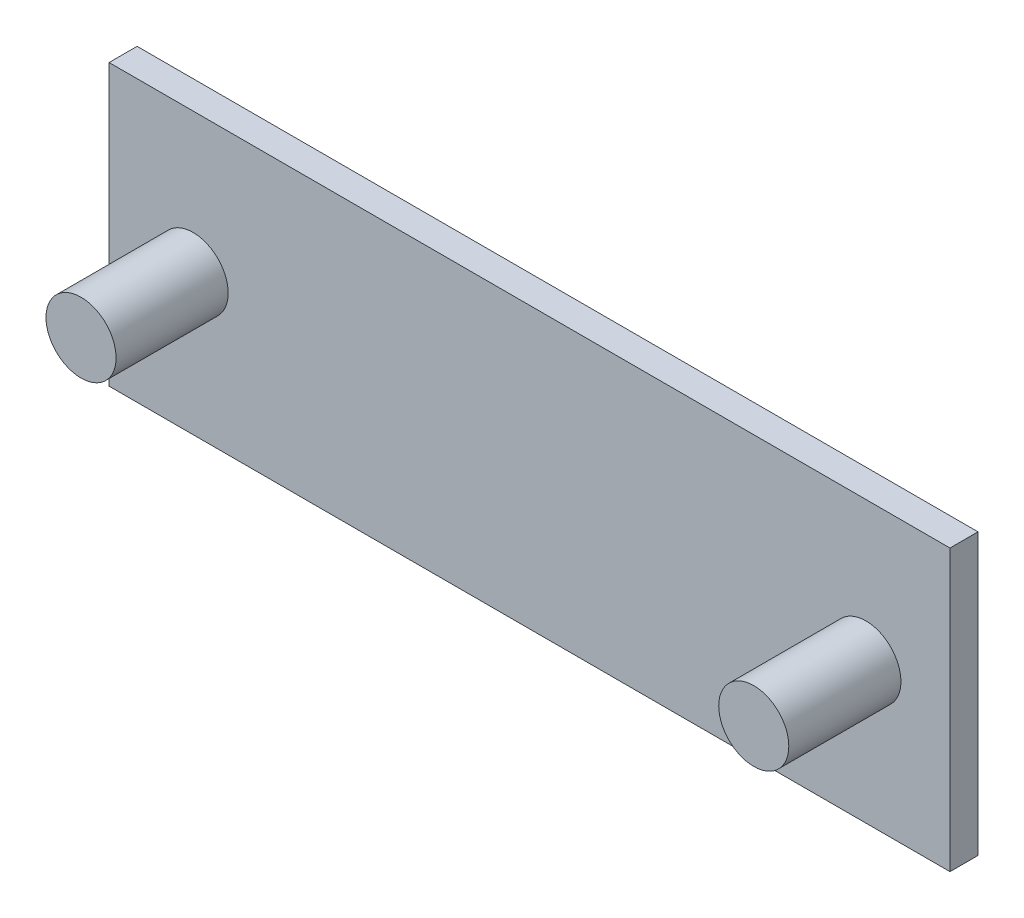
ISO-10303-21;
HEADER;
FILE_DESCRIPTION(('STEP AP214'),'2;1');
FILE_NAME('part.step','',(''),(''),'','','');
FILE_SCHEMA(('AUTOMOTIVE_DESIGN { 1 0 10303 214 1 1 1 1 }'));
ENDSEC;
DATA;
#1=APPLICATION_CONTEXT('core data for automotive mechanical design processes');
#2=APPLICATION_PROTOCOL_DEFINITION('international standard','automotive_design',2000,#1);
#3=PRODUCT_CONTEXT('',#1,'mechanical');
#4=PRODUCT('Part','Part','',(#3));
#5=PRODUCT_RELATED_PRODUCT_CATEGORY('part','',(#4));
#6=PRODUCT_DEFINITION_FORMATION('','',#4);
#7=PRODUCT_DEFINITION_CONTEXT('part definition',#1,'design');
#8=PRODUCT_DEFINITION('design','',#6,#7);
#9=PRODUCT_DEFINITION_SHAPE('','',#8);
#10=(LENGTH_UNIT() NAMED_UNIT(*) SI_UNIT(.MILLI.,.METRE.));
#11=(NAMED_UNIT(*) PLANE_ANGLE_UNIT() SI_UNIT($,.RADIAN.));
#12=(NAMED_UNIT(*) SI_UNIT($,.STERADIAN.) SOLID_ANGLE_UNIT());
#13=UNCERTAINTY_MEASURE_WITH_UNIT(LENGTH_MEASURE(1.E-05),#10,'distance_accuracy_value','');
#14=(GEOMETRIC_REPRESENTATION_CONTEXT(3) GLOBAL_UNCERTAINTY_ASSIGNED_CONTEXT((#13)) GLOBAL_UNIT_ASSIGNED_CONTEXT((#10,
#11,#12)) REPRESENTATION_CONTEXT('',''));
#15=CARTESIAN_POINT('',(0.,0.,0.));
#16=DIRECTION('',(0.,0.,1.));
#17=DIRECTION('',(1.,0.,0.));
#18=AXIS2_PLACEMENT_3D('',#15,#16,#17);
#19=CARTESIAN_POINT('',(0.,100.,10.));
#20=DIRECTION('',(0.,0.,-1.));
#21=DIRECTION('',(-1.,0.,0.));
#22=AXIS2_PLACEMENT_3D('',#19,#20,#21);
#23=PLANE('',#22);
#24=CARTESIAN_POINT('',(30.,50.,10.));
#25=DIRECTION('',(0.,0.,-1.));
#26=DIRECTION('',(-1.,0.,0.));
#27=AXIS2_PLACEMENT_3D('',#24,#25,#26);
#28=CIRCLE('',#27,12.5);
#29=CARTESIAN_POINT('',(17.5,50.,10.));
#30=VERTEX_POINT('',#29);
#31=EDGE_CURVE('E40',#30,#30,#28,.F.);
#32=ORIENTED_EDGE('',*,*,#31,.F.);
#33=EDGE_LOOP('',(#32));
#34=FACE_BOUND('',#33,.T.);
#35=DIRECTION('',(0.,-1.,0.));
#36=VECTOR('',#35,1.);
#37=CARTESIAN_POINT('',(0.,100.,10.));
#38=LINE('',#37,#36);
#39=CARTESIAN_POINT('',(0.,100.,10.));
#40=VERTEX_POINT('',#39);
#41=CARTESIAN_POINT('',(0.,0.,10.));
#42=VERTEX_POINT('',#41);
#43=EDGE_CURVE('E84',#40,#42,#38,.T.);
#44=ORIENTED_EDGE('',*,*,#43,.T.);
#45=DIRECTION('',(1.,0.,0.));
#46=VECTOR('',#45,1.);
#47=CARTESIAN_POINT('',(0.,0.,10.));
#48=LINE('',#47,#46);
#49=CARTESIAN_POINT('',(300.,0.,10.));
#50=VERTEX_POINT('',#49);
#51=EDGE_CURVE('E79',#42,#50,#48,.T.);
#52=ORIENTED_EDGE('',*,*,#51,.T.);
#53=DIRECTION('',(0.,1.,0.));
#54=VECTOR('',#53,1.);
#55=CARTESIAN_POINT('',(300.,0.,10.));
#56=LINE('',#55,#54);
#57=CARTESIAN_POINT('',(300.,100.,10.));
#58=VERTEX_POINT('',#57);
#59=EDGE_CURVE('E82',#50,#58,#56,.T.);
#60=ORIENTED_EDGE('',*,*,#59,.T.);
#61=DIRECTION('',(-1.,0.,0.));
#62=VECTOR('',#61,1.);
#63=CARTESIAN_POINT('',(300.,100.,10.));
#64=LINE('',#63,#62);
#65=EDGE_CURVE('E48',#58,#40,#64,.T.);
#66=ORIENTED_EDGE('',*,*,#65,.T.);
#67=EDGE_LOOP('',(#44,#52,#60,#66));
#68=FACE_BOUND('',#67,.T.);
#69=CARTESIAN_POINT('',(270.,50.,10.));
#70=DIRECTION('',(0.,0.,-1.));
#71=DIRECTION('',(-1.,0.,0.));
#72=AXIS2_PLACEMENT_3D('',#69,#70,#71);
#73=CIRCLE('',#72,12.5);
#74=CARTESIAN_POINT('',(257.5,50.,10.));
#75=VERTEX_POINT('',#74);
#76=EDGE_CURVE('E11',#75,#75,#73,.F.);
#77=ORIENTED_EDGE('',*,*,#76,.F.);
#78=EDGE_LOOP('',(#77));
#79=FACE_BOUND('',#78,.T.);
#80=ADVANCED_FACE('F31',(#34,#68,#79),#23,.F.);
#81=CARTESIAN_POINT('',(0.,100.,10.));
#82=DIRECTION('',(1.,0.,0.));
#83=DIRECTION('',(0.,1.,0.));
#84=AXIS2_PLACEMENT_3D('',#81,#82,#83);
#85=PLANE('',#84);
#86=DIRECTION('',(0.,-1.,0.));
#87=VECTOR('',#86,1.);
#88=CARTESIAN_POINT('',(0.,100.,0.));
#89=LINE('',#88,#87);
#90=CARTESIAN_POINT('',(0.,100.,0.));
#91=VERTEX_POINT('',#90);
#92=CARTESIAN_POINT('',(0.,0.,0.));
#93=VERTEX_POINT('',#92);
#94=EDGE_CURVE('E99',#91,#93,#89,.T.);
#95=ORIENTED_EDGE('',*,*,#94,.T.);
#96=DIRECTION('',(0.,0.,-1.));
#97=VECTOR('',#96,1.);
#98=CARTESIAN_POINT('',(0.,0.,10.));
#99=LINE('',#98,#97);
#100=EDGE_CURVE('E90',#42,#93,#99,.T.);
#101=ORIENTED_EDGE('',*,*,#100,.F.);
#102=ORIENTED_EDGE('',*,*,#43,.F.);
#103=DIRECTION('',(0.,0.,-1.));
#104=VECTOR('',#103,1.);
#105=CARTESIAN_POINT('',(0.,100.,10.));
#106=LINE('',#105,#104);
#107=EDGE_CURVE('E95',#40,#91,#106,.T.);
#108=ORIENTED_EDGE('',*,*,#107,.T.);
#109=EDGE_LOOP('',(#95,#101,#102,#108));
#110=FACE_BOUND('',#109,.T.);
#111=ADVANCED_FACE('F33',(#110),#85,.F.);
#112=CARTESIAN_POINT('',(0.,0.,10.));
#113=DIRECTION('',(0.,1.,0.));
#114=DIRECTION('',(0.,0.,1.));
#115=AXIS2_PLACEMENT_3D('',#112,#113,#114);
#116=PLANE('',#115);
#117=DIRECTION('',(1.,0.,0.));
#118=VECTOR('',#117,1.);
#119=CARTESIAN_POINT('',(0.,0.,0.));
#120=LINE('',#119,#118);
#121=CARTESIAN_POINT('',(300.,0.,0.));
#122=VERTEX_POINT('',#121);
#123=EDGE_CURVE('E89',#93,#122,#120,.T.);
#124=ORIENTED_EDGE('',*,*,#123,.T.);
#125=DIRECTION('',(0.,0.,-1.));
#126=VECTOR('',#125,1.);
#127=CARTESIAN_POINT('',(300.,0.,10.));
#128=LINE('',#127,#126);
#129=EDGE_CURVE('E87',#50,#122,#128,.T.);
#130=ORIENTED_EDGE('',*,*,#129,.F.);
#131=ORIENTED_EDGE('',*,*,#51,.F.);
#132=ORIENTED_EDGE('',*,*,#100,.T.);
#133=EDGE_LOOP('',(#124,#130,#131,#132));
#134=FACE_BOUND('',#133,.T.);
#135=ADVANCED_FACE('F88',(#134),#116,.F.);
#136=CARTESIAN_POINT('',(300.,0.,10.));
#137=DIRECTION('',(-1.,0.,0.));
#138=DIRECTION('',(0.,0.,1.));
#139=AXIS2_PLACEMENT_3D('',#136,#137,#138);
#140=PLANE('',#139);
#141=DIRECTION('',(0.,1.,0.));
#142=VECTOR('',#141,1.);
#143=CARTESIAN_POINT('',(300.,0.,0.));
#144=LINE('',#143,#142);
#145=CARTESIAN_POINT('',(300.,100.,0.));
#146=VERTEX_POINT('',#145);
#147=EDGE_CURVE('E65',#122,#146,#144,.T.);
#148=ORIENTED_EDGE('',*,*,#147,.T.);
#149=DIRECTION('',(0.,0.,-1.));
#150=VECTOR('',#149,1.);
#151=CARTESIAN_POINT('',(300.,100.,10.));
#152=LINE('',#151,#150);
#153=EDGE_CURVE('E91',#58,#146,#152,.T.);
#154=ORIENTED_EDGE('',*,*,#153,.F.);
#155=ORIENTED_EDGE('',*,*,#59,.F.);
#156=ORIENTED_EDGE('',*,*,#129,.T.);
#157=EDGE_LOOP('',(#148,#154,#155,#156));
#158=FACE_BOUND('',#157,.T.);
#159=ADVANCED_FACE('F93',(#158),#140,.F.);
#160=CARTESIAN_POINT('',(300.,100.,10.));
#161=DIRECTION('',(0.,-1.,0.));
#162=DIRECTION('',(1.,0.,0.));
#163=AXIS2_PLACEMENT_3D('',#160,#161,#162);
#164=PLANE('',#163);
#165=DIRECTION('',(-1.,0.,0.));
#166=VECTOR('',#165,1.);
#167=CARTESIAN_POINT('',(300.,100.,0.));
#168=LINE('',#167,#166);
#169=EDGE_CURVE('E71',#146,#91,#168,.T.);
#170=ORIENTED_EDGE('',*,*,#169,.T.);
#171=ORIENTED_EDGE('',*,*,#107,.F.);
#172=ORIENTED_EDGE('',*,*,#65,.F.);
#173=ORIENTED_EDGE('',*,*,#153,.T.);
#174=EDGE_LOOP('',(#170,#171,#172,#173));
#175=FACE_BOUND('',#174,.T.);
#176=ADVANCED_FACE('F125',(#175),#164,.F.);
#177=CARTESIAN_POINT('',(0.,100.,0.));
#178=DIRECTION('',(0.,0.,-1.));
#179=DIRECTION('',(-1.,0.,0.));
#180=AXIS2_PLACEMENT_3D('',#177,#178,#179);
#181=PLANE('',#180);
#182=ORIENTED_EDGE('',*,*,#94,.F.);
#183=ORIENTED_EDGE('',*,*,#169,.F.);
#184=ORIENTED_EDGE('',*,*,#147,.F.);
#185=ORIENTED_EDGE('',*,*,#123,.F.);
#186=EDGE_LOOP('',(#182,#183,#184,#185));
#187=FACE_BOUND('',#186,.T.);
#188=ADVANCED_FACE('F122',(#187),#181,.T.);
#189=CARTESIAN_POINT('',(30.,50.,50.));
#190=DIRECTION('',(0.,0.,-1.));
#191=DIRECTION('',(-1.,0.,0.));
#192=AXIS2_PLACEMENT_3D('',#189,#190,#191);
#193=CYLINDRICAL_SURFACE('',#192,12.5);
#194=CARTESIAN_POINT('',(30.,50.,50.));
#195=DIRECTION('',(0.,0.,1.));
#196=DIRECTION('',(1.,0.,0.));
#197=AXIS2_PLACEMENT_3D('',#194,#195,#196);
#198=CIRCLE('',#197,12.5);
#199=CARTESIAN_POINT('',(42.5,50.,50.));
#200=VERTEX_POINT('',#199);
#201=EDGE_CURVE('E102',#200,#200,#198,.T.);
#202=ORIENTED_EDGE('',*,*,#201,.F.);
#203=EDGE_LOOP('',(#202));
#204=FACE_BOUND('',#203,.T.);
#205=ORIENTED_EDGE('',*,*,#31,.T.);
#206=EDGE_LOOP('',(#205));
#207=FACE_BOUND('',#206,.T.);
#208=ADVANCED_FACE('F111',(#204,#207),#193,.T.);
#209=CARTESIAN_POINT('',(30.,50.,50.));
#210=DIRECTION('',(0.,0.,1.));
#211=DIRECTION('',(1.,0.,0.));
#212=AXIS2_PLACEMENT_3D('',#209,#210,#211);
#213=PLANE('',#212);
#214=ORIENTED_EDGE('',*,*,#201,.T.);
#215=EDGE_LOOP('',(#214));
#216=FACE_BOUND('',#215,.T.);
#217=ADVANCED_FACE('F153',(#216),#213,.T.);
#218=CARTESIAN_POINT('',(270.,50.,50.));
#219=DIRECTION('',(0.,0.,-1.));
#220=DIRECTION('',(-1.,0.,0.));
#221=AXIS2_PLACEMENT_3D('',#218,#219,#220);
#222=CYLINDRICAL_SURFACE('',#221,12.5);
#223=CARTESIAN_POINT('',(270.,50.,50.));
#224=DIRECTION('',(0.,0.,1.));
#225=DIRECTION('',(1.,0.,0.));
#226=AXIS2_PLACEMENT_3D('',#223,#224,#225);
#227=CIRCLE('',#226,12.5);
#228=CARTESIAN_POINT('',(282.5,50.,50.));
#229=VERTEX_POINT('',#228);
#230=EDGE_CURVE('E204',#229,#229,#227,.T.);
#231=ORIENTED_EDGE('',*,*,#230,.F.);
#232=EDGE_LOOP('',(#231));
#233=FACE_BOUND('',#232,.T.);
#234=ORIENTED_EDGE('',*,*,#76,.T.);
#235=EDGE_LOOP('',(#234));
#236=FACE_BOUND('',#235,.T.);
#237=ADVANCED_FACE('F160',(#233,#236),#222,.T.);
#238=CARTESIAN_POINT('',(270.,50.,50.));
#239=DIRECTION('',(0.,0.,1.));
#240=DIRECTION('',(1.,0.,0.));
#241=AXIS2_PLACEMENT_3D('',#238,#239,#240);
#242=PLANE('',#241);
#243=ORIENTED_EDGE('',*,*,#230,.T.);
#244=EDGE_LOOP('',(#243));
#245=FACE_BOUND('',#244,.T.);
#246=ADVANCED_FACE('F167',(#245),#242,.T.);
#247=CLOSED_SHELL('',(#80,#111,#135,#159,#176,#188,#208,#217,#237,#246));
#248=MANIFOLD_SOLID_BREP('B2',#247);
#249=ADVANCED_BREP_SHAPE_REPRESENTATION('',(#18,#248),#14);
#250=SHAPE_DEFINITION_REPRESENTATION(#9,#249);
ENDSEC;
END-ISO-10303-21;
